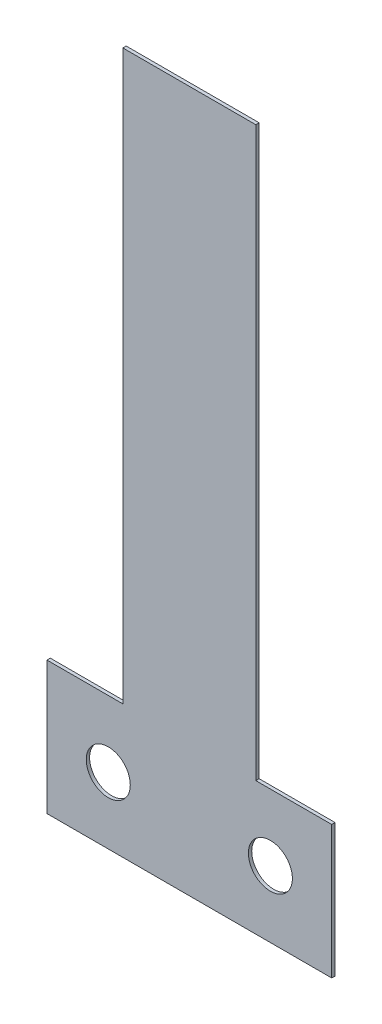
ISO-10303-21;
HEADER;
FILE_DESCRIPTION(('STEP AP214'),'2;1');
FILE_NAME('part.step','',(''),(''),'','','');
FILE_SCHEMA(('AUTOMOTIVE_DESIGN { 1 0 10303 214 1 1 1 1 }'));
ENDSEC;
DATA;
#1=APPLICATION_CONTEXT('core data for automotive mechanical design processes');
#2=APPLICATION_PROTOCOL_DEFINITION('international standard','automotive_design',2000,#1);
#3=PRODUCT_CONTEXT('',#1,'mechanical');
#4=PRODUCT('Part','Part','',(#3));
#5=PRODUCT_RELATED_PRODUCT_CATEGORY('part','',(#4));
#6=PRODUCT_DEFINITION_FORMATION('','',#4);
#7=PRODUCT_DEFINITION_CONTEXT('part definition',#1,'design');
#8=PRODUCT_DEFINITION('design','',#6,#7);
#9=PRODUCT_DEFINITION_SHAPE('','',#8);
#10=(LENGTH_UNIT() NAMED_UNIT(*) SI_UNIT(.MILLI.,.METRE.));
#11=(NAMED_UNIT(*) PLANE_ANGLE_UNIT() SI_UNIT($,.RADIAN.));
#12=(NAMED_UNIT(*) SI_UNIT($,.STERADIAN.) SOLID_ANGLE_UNIT());
#13=UNCERTAINTY_MEASURE_WITH_UNIT(LENGTH_MEASURE(1.E-05),#10,'distance_accuracy_value','');
#14=(GEOMETRIC_REPRESENTATION_CONTEXT(3) GLOBAL_UNCERTAINTY_ASSIGNED_CONTEXT((#13)) GLOBAL_UNIT_ASSIGNED_CONTEXT((#10,
#11,#12)) REPRESENTATION_CONTEXT('',''));
#15=CARTESIAN_POINT('',(0.,0.,0.));
#16=DIRECTION('',(0.,0.,1.));
#17=DIRECTION('',(1.,0.,0.));
#18=AXIS2_PLACEMENT_3D('',#15,#16,#17);
#19=CARTESIAN_POINT('',(-11.9126,5.5626,0.2794));
#20=DIRECTION('',(0.,-1.,0.));
#21=DIRECTION('',(0.,0.,-1.));
#22=AXIS2_PLACEMENT_3D('',#19,#20,#21);
#23=PLANE('',#22);
#24=DIRECTION('',(0.,0.,1.));
#25=VECTOR('',#24,1.);
#26=CARTESIAN_POINT('',(-5.5626,5.5626,0.));
#27=LINE('',#26,#25);
#28=CARTESIAN_POINT('',(-5.5626,5.5626,0.));
#29=VERTEX_POINT('',#28);
#30=CARTESIAN_POINT('',(-5.5626,5.5626,0.2794));
#31=VERTEX_POINT('',#30);
#32=EDGE_CURVE('E141',#29,#31,#27,.T.);
#33=ORIENTED_EDGE('',*,*,#32,.F.);
#34=DIRECTION('',(-1.,0.,0.));
#35=VECTOR('',#34,1.);
#36=CARTESIAN_POINT('',(-11.9126,5.5626,0.));
#37=LINE('',#36,#35);
#38=CARTESIAN_POINT('',(-11.9126,5.5626,0.));
#39=VERTEX_POINT('',#38);
#40=EDGE_CURVE('E162',#29,#39,#37,.T.);
#41=ORIENTED_EDGE('',*,*,#40,.T.);
#42=DIRECTION('',(0.,0.,-1.));
#43=VECTOR('',#42,1.);
#44=CARTESIAN_POINT('',(-11.9126,5.5626,0.2794));
#45=LINE('',#44,#43);
#46=CARTESIAN_POINT('',(-11.9126,5.5626,0.2794));
#47=VERTEX_POINT('',#46);
#48=EDGE_CURVE('E44',#47,#39,#45,.T.);
#49=ORIENTED_EDGE('',*,*,#48,.F.);
#50=DIRECTION('',(-1.,0.,0.));
#51=VECTOR('',#50,1.);
#52=CARTESIAN_POINT('',(-11.9126,5.5626,0.2794));
#53=LINE('',#52,#51);
#54=EDGE_CURVE('E152',#31,#47,#53,.T.);
#55=ORIENTED_EDGE('',*,*,#54,.F.);
#56=EDGE_LOOP('',(#33,#41,#49,#55));
#57=FACE_BOUND('',#56,.T.);
#58=ADVANCED_FACE('F35',(#57),#23,.F.);
#59=CARTESIAN_POINT('',(11.9126,-5.5626,0.2794));
#60=DIRECTION('',(-1.,0.,0.));
#61=DIRECTION('',(0.,0.,1.));
#62=AXIS2_PLACEMENT_3D('',#59,#60,#61);
#63=PLANE('',#62);
#64=DIRECTION('',(0.,1.,0.));
#65=VECTOR('',#64,1.);
#66=CARTESIAN_POINT('',(11.9126,-5.5626,0.));
#67=LINE('',#66,#65);
#68=CARTESIAN_POINT('',(11.9126,-5.5626,0.));
#69=VERTEX_POINT('',#68);
#70=CARTESIAN_POINT('',(11.9126,5.5626,0.));
#71=VERTEX_POINT('',#70);
#72=EDGE_CURVE('E166',#69,#71,#67,.T.);
#73=ORIENTED_EDGE('',*,*,#72,.T.);
#74=DIRECTION('',(0.,0.,-1.));
#75=VECTOR('',#74,1.);
#76=CARTESIAN_POINT('',(11.9126,5.5626,0.2794));
#77=LINE('',#76,#75);
#78=CARTESIAN_POINT('',(11.9126,5.5626,0.2794));
#79=VERTEX_POINT('',#78);
#80=EDGE_CURVE('E11',#79,#71,#77,.T.);
#81=ORIENTED_EDGE('',*,*,#80,.F.);
#82=DIRECTION('',(0.,1.,0.));
#83=VECTOR('',#82,1.);
#84=CARTESIAN_POINT('',(11.9126,-5.5626,0.2794));
#85=LINE('',#84,#83);
#86=CARTESIAN_POINT('',(11.9126,-5.5626,0.2794));
#87=VERTEX_POINT('',#86);
#88=EDGE_CURVE('E150',#87,#79,#85,.T.);
#89=ORIENTED_EDGE('',*,*,#88,.F.);
#90=DIRECTION('',(0.,0.,-1.));
#91=VECTOR('',#90,1.);
#92=CARTESIAN_POINT('',(11.9126,-5.5626,0.2794));
#93=LINE('',#92,#91);
#94=EDGE_CURVE('E174',#87,#69,#93,.T.);
#95=ORIENTED_EDGE('',*,*,#94,.T.);
#96=EDGE_LOOP('',(#73,#81,#89,#95));
#97=FACE_BOUND('',#96,.T.);
#98=ADVANCED_FACE('F37',(#97),#63,.F.);
#99=CARTESIAN_POINT('',(5.56260000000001,5.5626,0.));
#100=VERTEX_POINT('',#99);
#101=EDGE_CURVE('E165',#71,#100,#37,.T.);
#102=ORIENTED_EDGE('',*,*,#101,.T.);
#103=DIRECTION('',(0.,0.,1.));
#104=VECTOR('',#103,1.);
#105=CARTESIAN_POINT('',(5.56260000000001,5.5626,0.));
#106=LINE('',#105,#104);
#107=CARTESIAN_POINT('',(5.56260000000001,5.5626,0.2794));
#108=VERTEX_POINT('',#107);
#109=EDGE_CURVE('E131',#100,#108,#106,.T.);
#110=ORIENTED_EDGE('',*,*,#109,.T.);
#111=EDGE_CURVE('E88',#79,#108,#53,.T.);
#112=ORIENTED_EDGE('',*,*,#111,.F.);
#113=ORIENTED_EDGE('',*,*,#80,.T.);
#114=EDGE_LOOP('',(#102,#110,#112,#113));
#115=FACE_BOUND('',#114,.T.);
#116=ADVANCED_FACE('F190',(#115),#23,.F.);
#117=CARTESIAN_POINT('',(-11.9126,-5.5626,0.2794));
#118=DIRECTION('',(1.,0.,0.));
#119=DIRECTION('',(0.,0.,-1.));
#120=AXIS2_PLACEMENT_3D('',#117,#118,#119);
#121=PLANE('',#120);
#122=DIRECTION('',(0.,-1.,0.));
#123=VECTOR('',#122,1.);
#124=CARTESIAN_POINT('',(-11.9126,-5.5626,0.));
#125=LINE('',#124,#123);
#126=CARTESIAN_POINT('',(-11.9126,-5.5626,0.));
#127=VERTEX_POINT('',#126);
#128=EDGE_CURVE('E170',#39,#127,#125,.T.);
#129=ORIENTED_EDGE('',*,*,#128,.T.);
#130=DIRECTION('',(0.,0.,-1.));
#131=VECTOR('',#130,1.);
#132=CARTESIAN_POINT('',(-11.9126,-5.5626,0.2794));
#133=LINE('',#132,#131);
#134=CARTESIAN_POINT('',(-11.9126,-5.5626,0.2794));
#135=VERTEX_POINT('',#134);
#136=EDGE_CURVE('E176',#135,#127,#133,.T.);
#137=ORIENTED_EDGE('',*,*,#136,.F.);
#138=DIRECTION('',(0.,-1.,0.));
#139=VECTOR('',#138,1.);
#140=CARTESIAN_POINT('',(-11.9126,-5.5626,0.2794));
#141=LINE('',#140,#139);
#142=EDGE_CURVE('E155',#47,#135,#141,.T.);
#143=ORIENTED_EDGE('',*,*,#142,.F.);
#144=ORIENTED_EDGE('',*,*,#48,.T.);
#145=EDGE_LOOP('',(#129,#137,#143,#144));
#146=FACE_BOUND('',#145,.T.);
#147=ADVANCED_FACE('F183',(#146),#121,.F.);
#148=CARTESIAN_POINT('',(-11.9126,-5.5626,0.2794));
#149=DIRECTION('',(0.,1.,0.));
#150=DIRECTION('',(-1.,0.,0.));
#151=AXIS2_PLACEMENT_3D('',#148,#149,#150);
#152=PLANE('',#151);
#153=DIRECTION('',(1.,0.,0.));
#154=VECTOR('',#153,1.);
#155=CARTESIAN_POINT('',(-11.9126,-5.5626,0.));
#156=LINE('',#155,#154);
#157=EDGE_CURVE('E82',#127,#69,#156,.T.);
#158=ORIENTED_EDGE('',*,*,#157,.T.);
#159=ORIENTED_EDGE('',*,*,#94,.F.);
#160=DIRECTION('',(1.,0.,0.));
#161=VECTOR('',#160,1.);
#162=CARTESIAN_POINT('',(-11.9126,-5.5626,0.2794));
#163=LINE('',#162,#161);
#164=EDGE_CURVE('E61',#135,#87,#163,.T.);
#165=ORIENTED_EDGE('',*,*,#164,.F.);
#166=ORIENTED_EDGE('',*,*,#136,.T.);
#167=EDGE_LOOP('',(#158,#159,#165,#166));
#168=FACE_BOUND('',#167,.T.);
#169=ADVANCED_FACE('F204',(#168),#152,.F.);
#170=CARTESIAN_POINT('',(0.,0.,0.2794));
#171=DIRECTION('',(0.,0.,-1.));
#172=DIRECTION('',(-1.,0.,0.));
#173=AXIS2_PLACEMENT_3D('',#170,#171,#172);
#174=PLANE('',#173);
#175=CARTESIAN_POINT('',(6.7818,0.,0.2794));
#176=DIRECTION('',(0.,0.,1.));
#177=DIRECTION('',(-1.,0.,0.));
#178=AXIS2_PLACEMENT_3D('',#175,#176,#177);
#179=CIRCLE('',#178,1.8415);
#180=CARTESIAN_POINT('',(4.9403,0.,0.2794));
#181=VERTEX_POINT('',#180);
#182=EDGE_CURVE('E236',#181,#181,#179,.T.);
#183=ORIENTED_EDGE('',*,*,#182,.F.);
#184=EDGE_LOOP('',(#183));
#185=FACE_BOUND('',#184,.T.);
#186=CARTESIAN_POINT('',(-6.7818,0.,0.2794));
#187=DIRECTION('',(0.,0.,1.));
#188=DIRECTION('',(1.,0.,0.));
#189=AXIS2_PLACEMENT_3D('',#186,#187,#188);
#190=CIRCLE('',#189,1.8415);
#191=CARTESIAN_POINT('',(-4.9403,0.,0.2794));
#192=VERTEX_POINT('',#191);
#193=EDGE_CURVE('E238',#192,#192,#190,.T.);
#194=ORIENTED_EDGE('',*,*,#193,.F.);
#195=EDGE_LOOP('',(#194));
#196=FACE_BOUND('',#195,.T.);
#197=ORIENTED_EDGE('',*,*,#88,.T.);
#198=ORIENTED_EDGE('',*,*,#111,.T.);
#199=DIRECTION('',(0.,1.,0.));
#200=VECTOR('',#199,1.);
#201=CARTESIAN_POINT('',(5.5626,53.086,0.2794));
#202=LINE('',#201,#200);
#203=CARTESIAN_POINT('',(5.5626,53.086,0.2794));
#204=VERTEX_POINT('',#203);
#205=EDGE_CURVE('E52',#108,#204,#202,.T.);
#206=ORIENTED_EDGE('',*,*,#205,.T.);
#207=DIRECTION('',(-1.,0.,0.));
#208=VECTOR('',#207,1.);
#209=CARTESIAN_POINT('',(-5.5626,53.086,0.2794));
#210=LINE('',#209,#208);
#211=CARTESIAN_POINT('',(-5.5626,53.086,0.2794));
#212=VERTEX_POINT('',#211);
#213=EDGE_CURVE('E116',#204,#212,#210,.T.);
#214=ORIENTED_EDGE('',*,*,#213,.T.);
#215=DIRECTION('',(0.,-1.,0.));
#216=VECTOR('',#215,1.);
#217=CARTESIAN_POINT('',(-5.5626,53.086,0.2794));
#218=LINE('',#217,#216);
#219=EDGE_CURVE('E132',#212,#31,#218,.T.);
#220=ORIENTED_EDGE('',*,*,#219,.T.);
#221=ORIENTED_EDGE('',*,*,#54,.T.);
#222=ORIENTED_EDGE('',*,*,#142,.T.);
#223=ORIENTED_EDGE('',*,*,#164,.T.);
#224=EDGE_LOOP('',(#197,#198,#206,#214,#220,#221,#222,#223));
#225=FACE_BOUND('',#224,.T.);
#226=ADVANCED_FACE('F191',(#185,#196,#225),#174,.F.);
#227=CARTESIAN_POINT('',(0.,0.,0.));
#228=DIRECTION('',(0.,0.,-1.));
#229=DIRECTION('',(-1.,0.,0.));
#230=AXIS2_PLACEMENT_3D('',#227,#228,#229);
#231=PLANE('',#230);
#232=CARTESIAN_POINT('',(6.7818,0.,0.));
#233=DIRECTION('',(0.,0.,1.));
#234=DIRECTION('',(-1.,0.,0.));
#235=AXIS2_PLACEMENT_3D('',#232,#233,#234);
#236=CIRCLE('',#235,1.8415);
#237=CARTESIAN_POINT('',(4.9403,0.,0.));
#238=VERTEX_POINT('',#237);
#239=EDGE_CURVE('E233',#238,#238,#236,.T.);
#240=ORIENTED_EDGE('',*,*,#239,.T.);
#241=EDGE_LOOP('',(#240));
#242=FACE_BOUND('',#241,.T.);
#243=CARTESIAN_POINT('',(-6.7818,0.,0.));
#244=DIRECTION('',(0.,0.,1.));
#245=DIRECTION('',(1.,0.,0.));
#246=AXIS2_PLACEMENT_3D('',#243,#244,#245);
#247=CIRCLE('',#246,1.8415);
#248=CARTESIAN_POINT('',(-4.9403,0.,0.));
#249=VERTEX_POINT('',#248);
#250=EDGE_CURVE('E241',#249,#249,#247,.T.);
#251=ORIENTED_EDGE('',*,*,#250,.T.);
#252=EDGE_LOOP('',(#251));
#253=FACE_BOUND('',#252,.T.);
#254=ORIENTED_EDGE('',*,*,#72,.F.);
#255=ORIENTED_EDGE('',*,*,#157,.F.);
#256=ORIENTED_EDGE('',*,*,#128,.F.);
#257=ORIENTED_EDGE('',*,*,#40,.F.);
#258=DIRECTION('',(0.,-1.,0.));
#259=VECTOR('',#258,1.);
#260=CARTESIAN_POINT('',(-5.5626,53.086,0.));
#261=LINE('',#260,#259);
#262=CARTESIAN_POINT('',(-5.5626,53.086,0.));
#263=VERTEX_POINT('',#262);
#264=EDGE_CURVE('E119',#263,#29,#261,.T.);
#265=ORIENTED_EDGE('',*,*,#264,.F.);
#266=DIRECTION('',(-1.,0.,0.));
#267=VECTOR('',#266,1.);
#268=CARTESIAN_POINT('',(-5.5626,53.086,0.));
#269=LINE('',#268,#267);
#270=CARTESIAN_POINT('',(5.5626,53.086,0.));
#271=VERTEX_POINT('',#270);
#272=EDGE_CURVE('E114',#271,#263,#269,.T.);
#273=ORIENTED_EDGE('',*,*,#272,.F.);
#274=DIRECTION('',(0.,1.,0.));
#275=VECTOR('',#274,1.);
#276=CARTESIAN_POINT('',(5.5626,53.086,0.));
#277=LINE('',#276,#275);
#278=EDGE_CURVE('E126',#100,#271,#277,.T.);
#279=ORIENTED_EDGE('',*,*,#278,.F.);
#280=ORIENTED_EDGE('',*,*,#101,.F.);
#281=EDGE_LOOP('',(#254,#255,#256,#257,#265,#273,#279,#280));
#282=FACE_BOUND('',#281,.T.);
#283=ADVANCED_FACE('F125',(#242,#253,#282),#231,.T.);
#284=CARTESIAN_POINT('',(5.5626,53.086,0.));
#285=DIRECTION('',(1.,0.,0.));
#286=DIRECTION('',(0.,1.,0.));
#287=AXIS2_PLACEMENT_3D('',#284,#285,#286);
#288=PLANE('',#287);
#289=ORIENTED_EDGE('',*,*,#205,.F.);
#290=ORIENTED_EDGE('',*,*,#109,.F.);
#291=ORIENTED_EDGE('',*,*,#278,.T.);
#292=DIRECTION('',(0.,0.,1.));
#293=VECTOR('',#292,1.);
#294=CARTESIAN_POINT('',(5.5626,53.086,0.));
#295=LINE('',#294,#293);
#296=EDGE_CURVE('E111',#271,#204,#295,.T.);
#297=ORIENTED_EDGE('',*,*,#296,.T.);
#298=EDGE_LOOP('',(#289,#290,#291,#297));
#299=FACE_BOUND('',#298,.T.);
#300=ADVANCED_FACE('F130',(#299),#288,.T.);
#301=CARTESIAN_POINT('',(-5.5626,53.086,0.));
#302=DIRECTION('',(-1.,0.,0.));
#303=DIRECTION('',(0.,-1.,0.));
#304=AXIS2_PLACEMENT_3D('',#301,#302,#303);
#305=PLANE('',#304);
#306=ORIENTED_EDGE('',*,*,#219,.F.);
#307=DIRECTION('',(0.,0.,1.));
#308=VECTOR('',#307,1.);
#309=CARTESIAN_POINT('',(-5.5626,53.086,0.));
#310=LINE('',#309,#308);
#311=EDGE_CURVE('E118',#263,#212,#310,.T.);
#312=ORIENTED_EDGE('',*,*,#311,.F.);
#313=ORIENTED_EDGE('',*,*,#264,.T.);
#314=ORIENTED_EDGE('',*,*,#32,.T.);
#315=EDGE_LOOP('',(#306,#312,#313,#314));
#316=FACE_BOUND('',#315,.T.);
#317=ADVANCED_FACE('F215',(#316),#305,.T.);
#318=CARTESIAN_POINT('',(-5.5626,53.086,0.));
#319=DIRECTION('',(0.,1.,0.));
#320=DIRECTION('',(0.,0.,1.));
#321=AXIS2_PLACEMENT_3D('',#318,#319,#320);
#322=PLANE('',#321);
#323=ORIENTED_EDGE('',*,*,#213,.F.);
#324=ORIENTED_EDGE('',*,*,#296,.F.);
#325=ORIENTED_EDGE('',*,*,#272,.T.);
#326=ORIENTED_EDGE('',*,*,#311,.T.);
#327=EDGE_LOOP('',(#323,#324,#325,#326));
#328=FACE_BOUND('',#327,.T.);
#329=ADVANCED_FACE('F113',(#328),#322,.T.);
#330=CARTESIAN_POINT('',(-6.7818,0.,0.));
#331=DIRECTION('',(0.,0.,1.));
#332=DIRECTION('',(1.,0.,0.));
#333=AXIS2_PLACEMENT_3D('',#330,#331,#332);
#334=CYLINDRICAL_SURFACE('',#333,1.8415);
#335=ORIENTED_EDGE('',*,*,#250,.F.);
#336=EDGE_LOOP('',(#335));
#337=FACE_BOUND('',#336,.T.);
#338=ORIENTED_EDGE('',*,*,#193,.T.);
#339=EDGE_LOOP('',(#338));
#340=FACE_BOUND('',#339,.T.);
#341=ADVANCED_FACE('F218',(#337,#340),#334,.F.);
#342=CARTESIAN_POINT('',(6.7818,0.,0.));
#343=DIRECTION('',(0.,0.,1.));
#344=DIRECTION('',(1.,0.,0.));
#345=AXIS2_PLACEMENT_3D('',#342,#343,#344);
#346=CYLINDRICAL_SURFACE('',#345,1.8415);
#347=ORIENTED_EDGE('',*,*,#239,.F.);
#348=EDGE_LOOP('',(#347));
#349=FACE_BOUND('',#348,.T.);
#350=ORIENTED_EDGE('',*,*,#182,.T.);
#351=EDGE_LOOP('',(#350));
#352=FACE_BOUND('',#351,.T.);
#353=ADVANCED_FACE('F224',(#349,#352),#346,.F.);
#354=CLOSED_SHELL('',(#58,#98,#116,#147,#169,#226,#283,#300,#317,#329,#341,#353));
#355=MANIFOLD_SOLID_BREP('B2',#354);
#356=ADVANCED_BREP_SHAPE_REPRESENTATION('',(#18,#355),#14);
#357=SHAPE_DEFINITION_REPRESENTATION(#9,#356);
ENDSEC;
END-ISO-10303-21;
